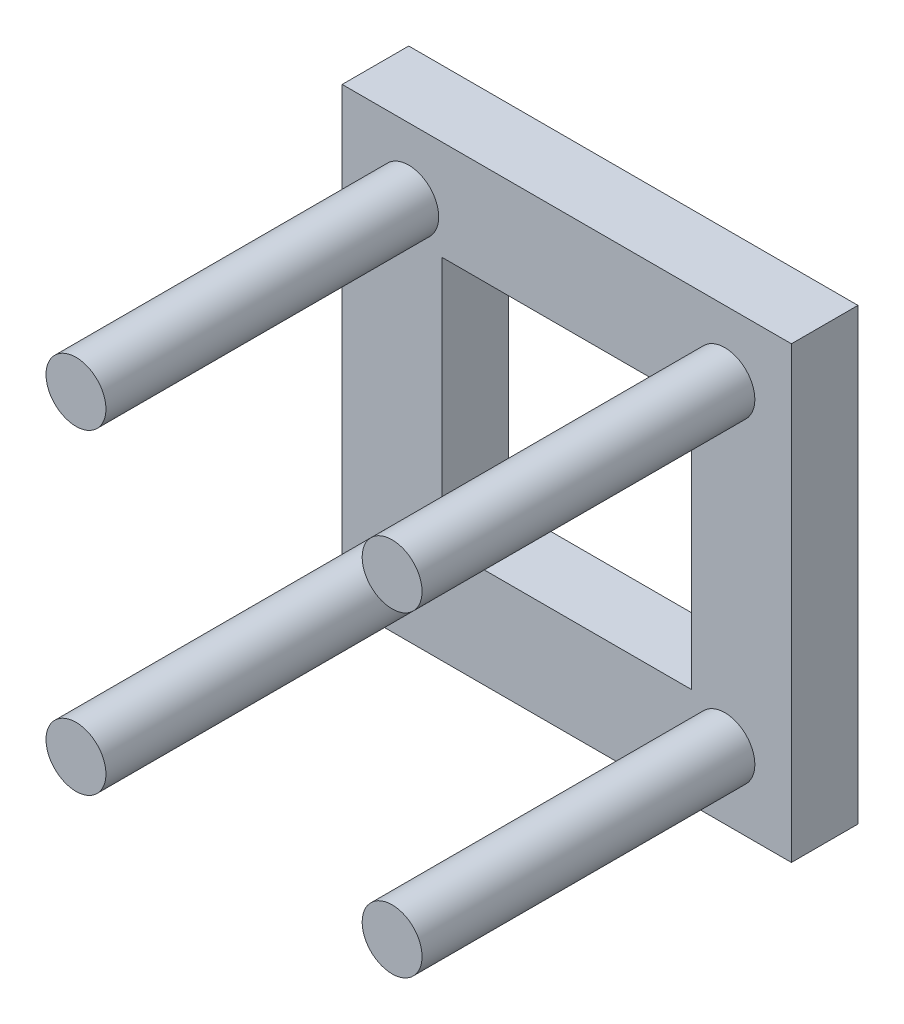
from build123d import *

# Parameters (mm, degrees)
ESQUISSE2_W        = 135
ESQUISSE2_H        = 135
ESQUISSE2_W_2      = 75
ESQUISSE2_H_2      = 75
BOSS_EXTRU_1_DEPTH = 20
ESQUISSE3_R        = 9
BOSS_EXTRU_2_DEPTH = 100


with BuildPart() as part:
    # Esquisse2 → Boss.-Extru.1 (new body)
    with BuildSketch(Plane.XY.offset(-1)):
        Rectangle(ESQUISSE2_W, ESQUISSE2_H)
        Rectangle(ESQUISSE2_W_2, ESQUISSE2_H_2, mode=Mode.SUBTRACT)
    extrude(amount=-BOSS_EXTRU_1_DEPTH)

    # Esquisse3 → Boss.-Extru.2 (add)
    with BuildSketch(Plane.XY.offset(-1)):
        with Locations(Location((-47.5, 47.5, 0), (0, 0, 180))):
            Circle(ESQUISSE3_R)
        with Locations(Location((47.5, 47.5, 0), (0, 0, 180))):
            Circle(ESQUISSE3_R)
        with Locations(Location((-47.5, -47.5, 0), (0, 0, 180))):
            Circle(ESQUISSE3_R)
        with Locations(Location((47.5, -47.5, 0), (0, 0, 180))):
            Circle(ESQUISSE3_R)
    extrude(amount=BOSS_EXTRU_2_DEPTH)


solid = part.part
